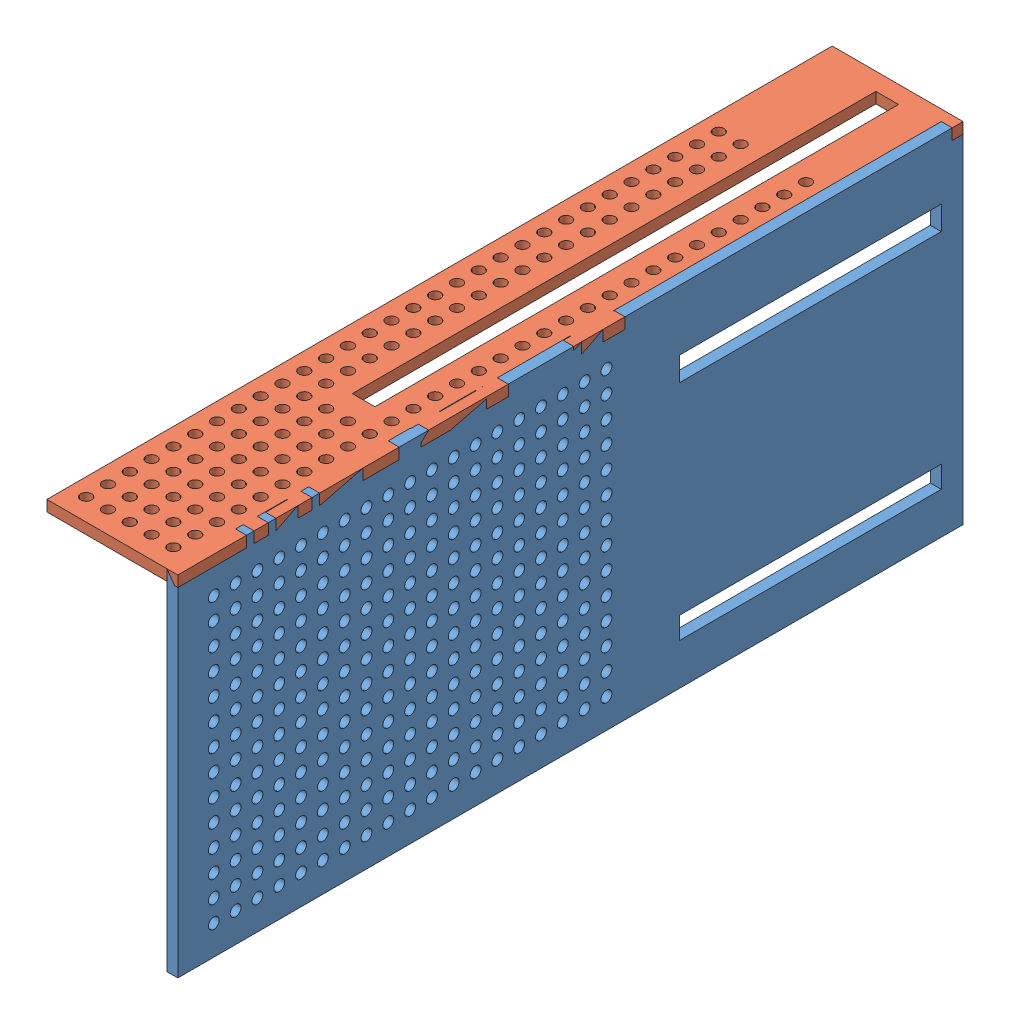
SolidWorks assembly Left_Shroud_real.SLDASM, configuration Default (file format 11000). Lengths in mm.
Overall size (38.1 178.68 228.6).
2 component instances, 2 part files, 3 mates.
Components (placement in the parent):
- Shroud_LargeSide-1: Shroud_LargeSide.SLDPRT [Default] at (16.8807 -11.9473 114.3) size (3.17 101.6 228.6)
- Shroud_ShortSide-1: Shroud_ShortSide.SLDPRT [Default] at (16.8807 86.4777 114.3) x (-1 0 0) z (0 0 1) size (38.1 80.26 228.6)
Mates (geometry in assembly coordinates):
- Coincident1: coincident: plane of Shroud_LargeSide-1 through (16.8807 -11.9473 114.3) normal (0 0 -1); plane of Shroud_ShortSide-1 through (16.8807 84.9336 114.3) normal (0 0 -1)
- Coincident3: coincident: plane of Shroud_LargeSide-1 through (18.4682 -62.7473 342.9) normal (1 0 0); plane of Shroud_ShortSide-1 through (18.4682 135.7336 342.9) normal (1 0 0)
- Coincident4: coincident: plane of Shroud_LargeSide-1 through (15.2932 38.8527 342.9) normal (0 1 0); plane of Shroud_ShortSide-1 through (15.2932 38.8527 342.9) normal (0 1 0)
